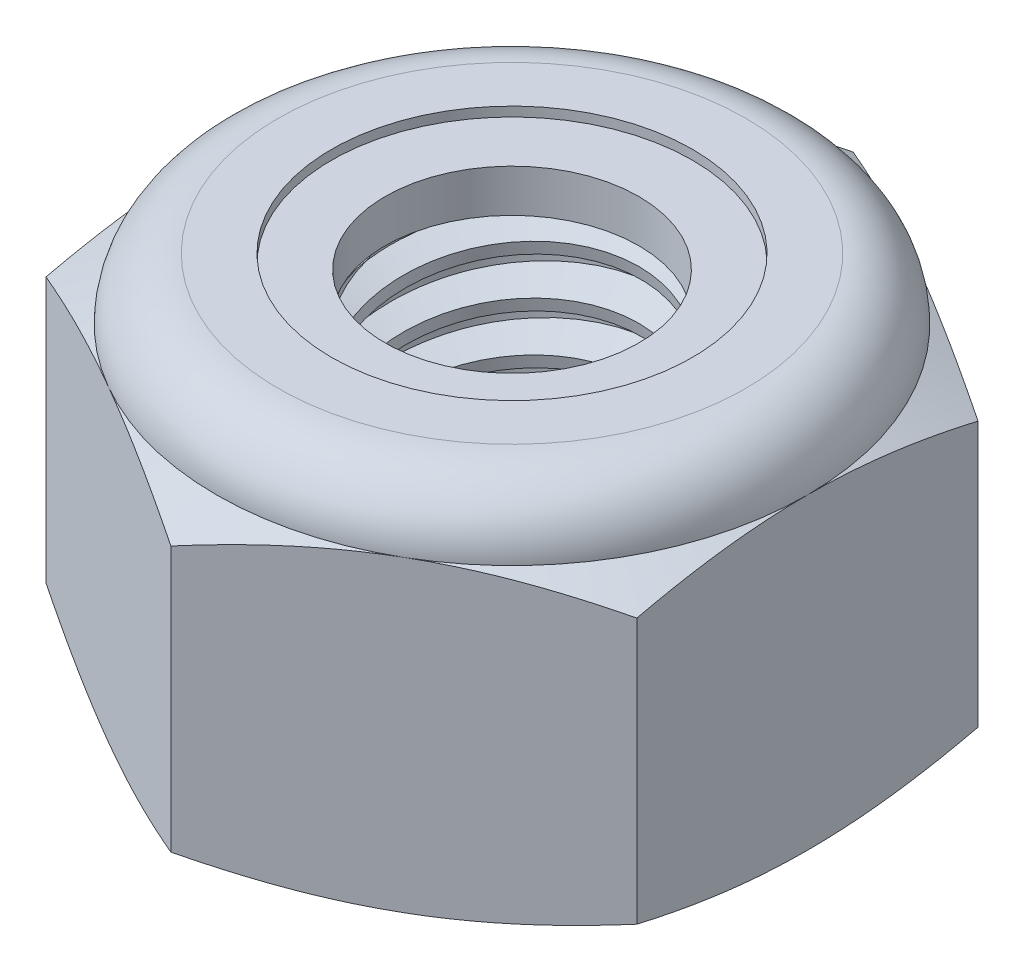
from build123d import *

# Parameters (mm, degrees)
EXTRUDE1_DEPTH      = 5.953125
SKETCH2_W           = 2.413
SKETCH2_H           = 5.953125
LPATTERN1_COUNT     = 8
LPATTERN1_PITCH     = 0.79375
LPATTERN1_COL_COUNT = 2
LPATTERN1_COL_PITCH = 0.79375


with BuildPart() as part:
    # Sketch1 → Extrude1 (new body)
    with BuildSketch(Plane(origin=(0, 0, 0), x_dir=(1, 0, 0), z_dir=(0, 1, 0))):
        Polygon((0, 5.499261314), (-4.7625, 2.749630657), (-4.7625, -2.749630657), (0, -5.499261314), (4.7625, -2.749630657), (4.7625, 2.749630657), align=None)
    extrude(amount=EXTRUDE1_DEPTH)

    # Sketch4 → Cut-Revolve2 (revolve, cut)
    with BuildSketch(Plane(origin=(0, 0, 0), x_dir=(0, 0, -1), z_dir=(1, 0, 0)), mode=Mode.PRIVATE) as cut_revolve2_sk:
        Polygon((0, 5.953125), (2.413, 5.953125), (2.045424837, 5.781721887), (2.045424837, 0.171403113), (2.413, 0), (0, 0), align=None)
    revolve(cut_revolve2_sk.sketch.rotate(Axis((0, 5.953125, 0), (0, 1, 0)), 55.135741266), axis=Axis((0, 5.953125, 0), (0, 1, 0)), mode=Mode.SUBTRACT)


with BuildPart() as body_2:
    # Sketch2 → Revolve1 (revolve)
    with BuildSketch(Plane(origin=(0, 0, 0), x_dir=(0, 0, -1), z_dir=(1, 0, 0))):
        with Locations((1.2065, 2.9765625)):
            Rectangle(SKETCH2_W, SKETCH2_H)
    revolve(axis=Axis((0, -2.413, 0), (0, 1, 0)))

    # Sketch3 → Cut-Revolve1 (revolve, cut)
    with BuildSketch(Plane(origin=(0, 0, 0), x_dir=(0, 0, -1), z_dir=(1, 0, 0)), mode=Mode.PRIVATE) as cut_revolve1_sk:
        Polygon((2.429102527, 5.855221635), (2.541820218, 5.169898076), (2.077629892, 5.344930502), (2.045424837, 5.540737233), align=None)
    cut_revolve1 = revolve(cut_revolve1_sk.sketch.rotate(Axis((0, 5.953125, 0.139697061), (0, -0.9867425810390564, -0.1622931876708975)), 180), axis=Axis((0, 5.953125, 0.139697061), (0, -0.9867425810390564, -0.1622931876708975)), mode=Mode.SUBTRACT)

    # LPattern1: Cut-Revolve1 ×8
    with Locations(*[(0, -i * LPATTERN1_PITCH, 0) for i in range(1, LPATTERN1_COUNT)]):
        add(cut_revolve1, mode=Mode.SUBTRACT)

    # LPattern1 col: Cut-Revolve1 ×2
    with Locations(*[(0, i * LPATTERN1_COL_PITCH, 0) for i in range(1, LPATTERN1_COL_COUNT)]):
        add(cut_revolve1, mode=Mode.SUBTRACT)


with BuildPart() as part_1:
    add(part.part)

    # Combine1: cut body 2
    add(body_2.part, mode=Mode.SUBTRACT)

    # Sketch5 → Cut-Revolve3 (revolve, cut)
    with BuildSketch(Plane(origin=(0, 0, 0), x_dir=(0, 0, -1), z_dir=(1, 0, 0)), mode=Mode.PRIVATE) as cut_revolve3_sk:
        with BuildLine():
            Line((0, 0), (4.7625, 0))
            Line((4.7625, 0), (5.499261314, 0.343557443))
            Line((5.499261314, 0.343557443), (5.499261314, 4.617380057))
            Line((5.499261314, 4.617380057), (4.7625, 4.9609375))
            ThreePointArc((4.7625, 4.9609375), (4.471895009, 5.662520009), (3.7703125, 5.953125))
            Line((3.7703125, 5.953125), (3.7703125, 7.223125))
            Line((3.7703125, 7.223125), (6.769261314, 7.223125))
            Line((6.769261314, 7.223125), (6.769261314, -1.27))
            Line((6.769261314, -1.27), (0, -1.27))
            Line((0, -1.27), (0, 0))
        make_face()
    revolve(cut_revolve3_sk.sketch.rotate(Axis((0, 0, 0), (0, 1, 0)), 55.135741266), axis=Axis((0, 0, 0), (0, 1, 0)), mode=Mode.SUBTRACT)

    # Sketch6 → Cut-Revolve4 (revolve, cut)
    with BuildSketch(Plane(origin=(0, 0, 0), x_dir=(0, 0, -1), z_dir=(1, 0, 0)), mode=Mode.PRIVATE) as cut_revolve4_sk:
        with BuildLine():
            Line((0, 4.9609375), (4.6101, 4.9609375))
            ThreePointArc((4.6101, 4.9609375), (4.364131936, 5.554756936), (3.7703125, 5.800725))
            Line((3.7703125, 5.800725), (2.907868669, 5.800725))
            Line((2.907868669, 5.800725), (2.907868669, 7.223125))
            Line((2.907868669, 7.223125), (0, 7.223125))
            Line((0, 7.223125), (0, 4.9609375))
        make_face()
    revolve(cut_revolve4_sk.sketch.rotate(Axis((0, 7.223125, 0), (0, 1, 0)), 55.135741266), axis=Axis((0, 7.223125, 0), (0, 1, 0)), mode=Mode.SUBTRACT)


with BuildPart() as body_2_2:
    # Sketch7 → Revolve2 (revolve)
    with BuildSketch(Plane(origin=(0, 0, 0), x_dir=(0, 0, -1), z_dir=(1, 0, 0))):
        with BuildLine():
            Line((2.045424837, 5.0371375), (4.530088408, 5.0371375))
            ThreePointArc((4.530088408, 5.0371375), (4.282601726, 5.527175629), (3.7703125, 5.724525))
            Line((3.7703125, 5.724525), (2.045424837, 5.724525))
            Line((2.045424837, 5.724525), (2.045424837, 5.0371375))
        make_face()
    revolve(axis=Axis((0, 5.0371375, 0), (0, 1, 0)))


solid = Compound([part_1.part, body_2_2.part])
